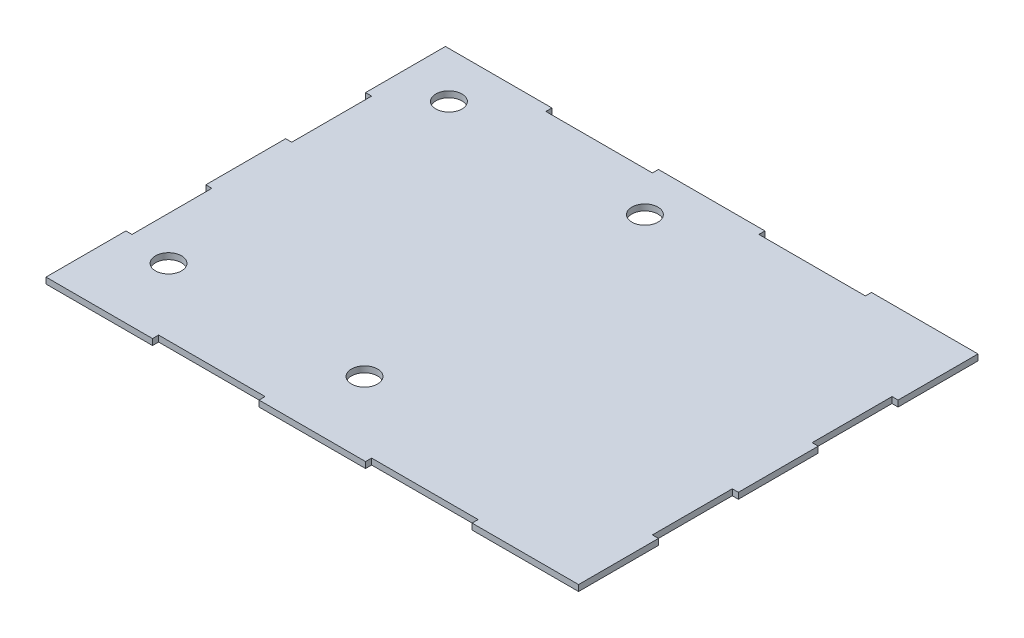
ISO-10303-21;
HEADER;
FILE_DESCRIPTION(('STEP AP214'),'2;1');
FILE_NAME('part.step','',(''),(''),'','','');
FILE_SCHEMA(('AUTOMOTIVE_DESIGN { 1 0 10303 214 1 1 1 1 }'));
ENDSEC;
DATA;
#1=APPLICATION_CONTEXT('core data for automotive mechanical design processes');
#2=APPLICATION_PROTOCOL_DEFINITION('international standard','automotive_design',2000,#1);
#3=PRODUCT_CONTEXT('',#1,'mechanical');
#4=PRODUCT('Part','Part','',(#3));
#5=PRODUCT_RELATED_PRODUCT_CATEGORY('part','',(#4));
#6=PRODUCT_DEFINITION_FORMATION('','',#4);
#7=PRODUCT_DEFINITION_CONTEXT('part definition',#1,'design');
#8=PRODUCT_DEFINITION('design','',#6,#7);
#9=PRODUCT_DEFINITION_SHAPE('','',#8);
#10=(LENGTH_UNIT() NAMED_UNIT(*) SI_UNIT(.MILLI.,.METRE.));
#11=(NAMED_UNIT(*) PLANE_ANGLE_UNIT() SI_UNIT($,.RADIAN.));
#12=(NAMED_UNIT(*) SI_UNIT($,.STERADIAN.) SOLID_ANGLE_UNIT());
#13=UNCERTAINTY_MEASURE_WITH_UNIT(LENGTH_MEASURE(1.E-05),#10,'distance_accuracy_value','');
#14=(GEOMETRIC_REPRESENTATION_CONTEXT(3) GLOBAL_UNCERTAINTY_ASSIGNED_CONTEXT((#13)) GLOBAL_UNIT_ASSIGNED_CONTEXT((#10,
#11,#12)) REPRESENTATION_CONTEXT('',''));
#15=CARTESIAN_POINT('',(0.,0.,0.));
#16=DIRECTION('',(0.,0.,1.));
#17=DIRECTION('',(1.,0.,0.));
#18=AXIS2_PLACEMENT_3D('',#15,#16,#17);
#19=CARTESIAN_POINT('',(60.0000000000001,2.28,75.));
#20=DIRECTION('',(0.,0.,-1.));
#21=DIRECTION('',(-1.,0.,0.));
#22=AXIS2_PLACEMENT_3D('',#19,#20,#21);
#23=PLANE('',#22);
#24=DIRECTION('',(1.,0.,0.));
#25=VECTOR('',#24,1.);
#26=CARTESIAN_POINT('',(60.0000000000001,0.,75.));
#27=LINE('',#26,#25);
#28=CARTESIAN_POINT('',(60.0000000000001,0.,75.));
#29=VERTEX_POINT('',#28);
#30=CARTESIAN_POINT('',(100.,0.,75.));
#31=VERTEX_POINT('',#30);
#32=EDGE_CURVE('E303',#29,#31,#27,.T.);
#33=ORIENTED_EDGE('',*,*,#32,.T.);
#34=DIRECTION('',(0.,-1.,0.));
#35=VECTOR('',#34,1.);
#36=CARTESIAN_POINT('',(100.,2.28,75.));
#37=LINE('',#36,#35);
#38=CARTESIAN_POINT('',(100.,2.28,75.));
#39=VERTEX_POINT('',#38);
#40=EDGE_CURVE('E11',#39,#31,#37,.T.);
#41=ORIENTED_EDGE('',*,*,#40,.F.);
#42=DIRECTION('',(1.,0.,0.));
#43=VECTOR('',#42,1.);
#44=CARTESIAN_POINT('',(60.0000000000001,2.28,75.));
#45=LINE('',#44,#43);
#46=CARTESIAN_POINT('',(60.0000000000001,2.28,75.));
#47=VERTEX_POINT('',#46);
#48=EDGE_CURVE('E373',#47,#39,#45,.T.);
#49=ORIENTED_EDGE('',*,*,#48,.F.);
#50=DIRECTION('',(0.,-1.,0.));
#51=VECTOR('',#50,1.);
#52=CARTESIAN_POINT('',(60.0000000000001,2.28,75.));
#53=LINE('',#52,#51);
#54=EDGE_CURVE('E299',#47,#29,#53,.T.);
#55=ORIENTED_EDGE('',*,*,#54,.T.);
#56=EDGE_LOOP('',(#33,#41,#49,#55));
#57=FACE_BOUND('',#56,.T.);
#58=ADVANCED_FACE('F37',(#57),#23,.F.);
#59=CARTESIAN_POINT('',(100.,2.28,45.));
#60=DIRECTION('',(-1.,0.,0.));
#61=DIRECTION('',(0.,0.,1.));
#62=AXIS2_PLACEMENT_3D('',#59,#60,#61);
#63=PLANE('',#62);
#64=DIRECTION('',(0.,0.,-1.));
#65=VECTOR('',#64,1.);
#66=CARTESIAN_POINT('',(100.,0.,45.));
#67=LINE('',#66,#65);
#68=CARTESIAN_POINT('',(100.,0.,45.));
#69=VERTEX_POINT('',#68);
#70=EDGE_CURVE('E306',#31,#69,#67,.T.);
#71=ORIENTED_EDGE('',*,*,#70,.T.);
#72=DIRECTION('',(0.,-1.,0.));
#73=VECTOR('',#72,1.);
#74=CARTESIAN_POINT('',(100.,2.28,45.));
#75=LINE('',#74,#73);
#76=CARTESIAN_POINT('',(100.,2.28,45.));
#77=VERTEX_POINT('',#76);
#78=EDGE_CURVE('E46',#77,#69,#75,.T.);
#79=ORIENTED_EDGE('',*,*,#78,.F.);
#80=DIRECTION('',(0.,0.,-1.));
#81=VECTOR('',#80,1.);
#82=CARTESIAN_POINT('',(100.,2.28,45.));
#83=LINE('',#82,#81);
#84=EDGE_CURVE('E182',#39,#77,#83,.T.);
#85=ORIENTED_EDGE('',*,*,#84,.F.);
#86=ORIENTED_EDGE('',*,*,#40,.T.);
#87=EDGE_LOOP('',(#71,#79,#85,#86));
#88=FACE_BOUND('',#87,.T.);
#89=ADVANCED_FACE('F511',(#88),#63,.F.);
#90=CARTESIAN_POINT('',(97.72,2.28,45.));
#91=DIRECTION('',(0.,0.,1.));
#92=DIRECTION('',(1.,0.,0.));
#93=AXIS2_PLACEMENT_3D('',#90,#91,#92);
#94=PLANE('',#93);
#95=DIRECTION('',(-1.,0.,0.));
#96=VECTOR('',#95,1.);
#97=CARTESIAN_POINT('',(97.72,0.,45.));
#98=LINE('',#97,#96);
#99=CARTESIAN_POINT('',(97.72,0.,45.));
#100=VERTEX_POINT('',#99);
#101=EDGE_CURVE('E308',#69,#100,#98,.T.);
#102=ORIENTED_EDGE('',*,*,#101,.T.);
#103=DIRECTION('',(0.,-1.,0.));
#104=VECTOR('',#103,1.);
#105=CARTESIAN_POINT('',(97.72,2.28,45.));
#106=LINE('',#105,#104);
#107=CARTESIAN_POINT('',(97.72,2.28,45.));
#108=VERTEX_POINT('',#107);
#109=EDGE_CURVE('E464',#108,#100,#106,.T.);
#110=ORIENTED_EDGE('',*,*,#109,.F.);
#111=DIRECTION('',(-1.,0.,0.));
#112=VECTOR('',#111,1.);
#113=CARTESIAN_POINT('',(97.72,2.28,45.));
#114=LINE('',#113,#112);
#115=EDGE_CURVE('E1002',#77,#108,#114,.T.);
#116=ORIENTED_EDGE('',*,*,#115,.F.);
#117=ORIENTED_EDGE('',*,*,#78,.T.);
#118=EDGE_LOOP('',(#102,#110,#116,#117));
#119=FACE_BOUND('',#118,.T.);
#120=ADVANCED_FACE('F515',(#119),#94,.F.);
#121=CARTESIAN_POINT('',(97.72,2.28,15.));
#122=DIRECTION('',(-1.,0.,0.));
#123=DIRECTION('',(0.,0.,1.));
#124=AXIS2_PLACEMENT_3D('',#121,#122,#123);
#125=PLANE('',#124);
#126=DIRECTION('',(0.,0.,-1.));
#127=VECTOR('',#126,1.);
#128=CARTESIAN_POINT('',(97.72,0.,15.));
#129=LINE('',#128,#127);
#130=CARTESIAN_POINT('',(97.72,0.,15.));
#131=VERTEX_POINT('',#130);
#132=EDGE_CURVE('E310',#100,#131,#129,.T.);
#133=ORIENTED_EDGE('',*,*,#132,.T.);
#134=DIRECTION('',(0.,-1.,0.));
#135=VECTOR('',#134,1.);
#136=CARTESIAN_POINT('',(97.72,2.28,15.));
#137=LINE('',#136,#135);
#138=CARTESIAN_POINT('',(97.72,2.28,15.));
#139=VERTEX_POINT('',#138);
#140=EDGE_CURVE('E461',#139,#131,#137,.T.);
#141=ORIENTED_EDGE('',*,*,#140,.F.);
#142=DIRECTION('',(0.,0.,-1.));
#143=VECTOR('',#142,1.);
#144=CARTESIAN_POINT('',(97.72,2.28,15.));
#145=LINE('',#144,#143);
#146=EDGE_CURVE('E1004',#108,#139,#145,.T.);
#147=ORIENTED_EDGE('',*,*,#146,.F.);
#148=ORIENTED_EDGE('',*,*,#109,.T.);
#149=EDGE_LOOP('',(#133,#141,#147,#148));
#150=FACE_BOUND('',#149,.T.);
#151=ADVANCED_FACE('F519',(#150),#125,.F.);
#152=CARTESIAN_POINT('',(100.,2.28,15.));
#153=DIRECTION('',(0.,0.,-1.));
#154=DIRECTION('',(-1.,0.,0.));
#155=AXIS2_PLACEMENT_3D('',#152,#153,#154);
#156=PLANE('',#155);
#157=DIRECTION('',(1.,0.,0.));
#158=VECTOR('',#157,1.);
#159=CARTESIAN_POINT('',(100.,0.,15.));
#160=LINE('',#159,#158);
#161=CARTESIAN_POINT('',(100.,0.,15.));
#162=VERTEX_POINT('',#161);
#163=EDGE_CURVE('E312',#131,#162,#160,.T.);
#164=ORIENTED_EDGE('',*,*,#163,.T.);
#165=DIRECTION('',(0.,-1.,0.));
#166=VECTOR('',#165,1.);
#167=CARTESIAN_POINT('',(100.,2.28,15.));
#168=LINE('',#167,#166);
#169=CARTESIAN_POINT('',(100.,2.28,15.));
#170=VERTEX_POINT('',#169);
#171=EDGE_CURVE('E458',#170,#162,#168,.T.);
#172=ORIENTED_EDGE('',*,*,#171,.F.);
#173=DIRECTION('',(1.,0.,0.));
#174=VECTOR('',#173,1.);
#175=CARTESIAN_POINT('',(100.,2.28,15.));
#176=LINE('',#175,#174);
#177=EDGE_CURVE('E1006',#139,#170,#176,.T.);
#178=ORIENTED_EDGE('',*,*,#177,.F.);
#179=ORIENTED_EDGE('',*,*,#140,.T.);
#180=EDGE_LOOP('',(#164,#172,#178,#179));
#181=FACE_BOUND('',#180,.T.);
#182=ADVANCED_FACE('F525',(#181),#156,.F.);
#183=CARTESIAN_POINT('',(100.,2.28,-15.));
#184=DIRECTION('',(-1.,0.,0.));
#185=DIRECTION('',(0.,0.,1.));
#186=AXIS2_PLACEMENT_3D('',#183,#184,#185);
#187=PLANE('',#186);
#188=DIRECTION('',(0.,0.,-1.));
#189=VECTOR('',#188,1.);
#190=CARTESIAN_POINT('',(100.,0.,-15.));
#191=LINE('',#190,#189);
#192=CARTESIAN_POINT('',(100.,0.,-15.));
#193=VERTEX_POINT('',#192);
#194=EDGE_CURVE('E314',#162,#193,#191,.T.);
#195=ORIENTED_EDGE('',*,*,#194,.T.);
#196=DIRECTION('',(0.,-1.,0.));
#197=VECTOR('',#196,1.);
#198=CARTESIAN_POINT('',(100.,2.28,-15.));
#199=LINE('',#198,#197);
#200=CARTESIAN_POINT('',(100.,2.28,-15.));
#201=VERTEX_POINT('',#200);
#202=EDGE_CURVE('E455',#201,#193,#199,.T.);
#203=ORIENTED_EDGE('',*,*,#202,.F.);
#204=DIRECTION('',(0.,0.,-1.));
#205=VECTOR('',#204,1.);
#206=CARTESIAN_POINT('',(100.,2.28,-15.));
#207=LINE('',#206,#205);
#208=EDGE_CURVE('E1008',#170,#201,#207,.T.);
#209=ORIENTED_EDGE('',*,*,#208,.F.);
#210=ORIENTED_EDGE('',*,*,#171,.T.);
#211=EDGE_LOOP('',(#195,#203,#209,#210));
#212=FACE_BOUND('',#211,.T.);
#213=ADVANCED_FACE('F529',(#212),#187,.F.);
#214=CARTESIAN_POINT('',(97.72,2.28,-15.));
#215=DIRECTION('',(0.,0.,1.));
#216=DIRECTION('',(1.,0.,0.));
#217=AXIS2_PLACEMENT_3D('',#214,#215,#216);
#218=PLANE('',#217);
#219=DIRECTION('',(-1.,0.,0.));
#220=VECTOR('',#219,1.);
#221=CARTESIAN_POINT('',(97.72,0.,-15.));
#222=LINE('',#221,#220);
#223=CARTESIAN_POINT('',(97.72,0.,-15.));
#224=VERTEX_POINT('',#223);
#225=EDGE_CURVE('E316',#193,#224,#222,.T.);
#226=ORIENTED_EDGE('',*,*,#225,.T.);
#227=DIRECTION('',(0.,-1.,0.));
#228=VECTOR('',#227,1.);
#229=CARTESIAN_POINT('',(97.72,2.28,-15.));
#230=LINE('',#229,#228);
#231=CARTESIAN_POINT('',(97.72,2.28,-15.));
#232=VERTEX_POINT('',#231);
#233=EDGE_CURVE('E452',#232,#224,#230,.T.);
#234=ORIENTED_EDGE('',*,*,#233,.F.);
#235=DIRECTION('',(-1.,0.,0.));
#236=VECTOR('',#235,1.);
#237=CARTESIAN_POINT('',(97.72,2.28,-15.));
#238=LINE('',#237,#236);
#239=EDGE_CURVE('E1010',#201,#232,#238,.T.);
#240=ORIENTED_EDGE('',*,*,#239,.F.);
#241=ORIENTED_EDGE('',*,*,#202,.T.);
#242=EDGE_LOOP('',(#226,#234,#240,#241));
#243=FACE_BOUND('',#242,.T.);
#244=ADVANCED_FACE('F533',(#243),#218,.F.);
#245=CARTESIAN_POINT('',(97.72,2.28,-45.));
#246=DIRECTION('',(-1.,0.,0.));
#247=DIRECTION('',(0.,0.,1.));
#248=AXIS2_PLACEMENT_3D('',#245,#246,#247);
#249=PLANE('',#248);
#250=DIRECTION('',(0.,0.,-1.));
#251=VECTOR('',#250,1.);
#252=CARTESIAN_POINT('',(97.72,0.,-45.));
#253=LINE('',#252,#251);
#254=CARTESIAN_POINT('',(97.72,0.,-45.));
#255=VERTEX_POINT('',#254);
#256=EDGE_CURVE('E318',#224,#255,#253,.T.);
#257=ORIENTED_EDGE('',*,*,#256,.T.);
#258=DIRECTION('',(0.,-1.,0.));
#259=VECTOR('',#258,1.);
#260=CARTESIAN_POINT('',(97.72,2.28,-45.));
#261=LINE('',#260,#259);
#262=CARTESIAN_POINT('',(97.72,2.28,-45.));
#263=VERTEX_POINT('',#262);
#264=EDGE_CURVE('E449',#263,#255,#261,.T.);
#265=ORIENTED_EDGE('',*,*,#264,.F.);
#266=DIRECTION('',(0.,0.,-1.));
#267=VECTOR('',#266,1.);
#268=CARTESIAN_POINT('',(97.72,2.28,-45.));
#269=LINE('',#268,#267);
#270=EDGE_CURVE('E1012',#232,#263,#269,.T.);
#271=ORIENTED_EDGE('',*,*,#270,.F.);
#272=ORIENTED_EDGE('',*,*,#233,.T.);
#273=EDGE_LOOP('',(#257,#265,#271,#272));
#274=FACE_BOUND('',#273,.T.);
#275=ADVANCED_FACE('F537',(#274),#249,.F.);
#276=CARTESIAN_POINT('',(100.,2.28,-45.));
#277=DIRECTION('',(0.,0.,-1.));
#278=DIRECTION('',(-1.,0.,0.));
#279=AXIS2_PLACEMENT_3D('',#276,#277,#278);
#280=PLANE('',#279);
#281=DIRECTION('',(1.,0.,0.));
#282=VECTOR('',#281,1.);
#283=CARTESIAN_POINT('',(100.,0.,-45.));
#284=LINE('',#283,#282);
#285=CARTESIAN_POINT('',(100.,0.,-45.));
#286=VERTEX_POINT('',#285);
#287=EDGE_CURVE('E320',#255,#286,#284,.T.);
#288=ORIENTED_EDGE('',*,*,#287,.T.);
#289=DIRECTION('',(0.,-1.,0.));
#290=VECTOR('',#289,1.);
#291=CARTESIAN_POINT('',(100.,2.28,-45.));
#292=LINE('',#291,#290);
#293=CARTESIAN_POINT('',(100.,2.28,-45.));
#294=VERTEX_POINT('',#293);
#295=EDGE_CURVE('E446',#294,#286,#292,.T.);
#296=ORIENTED_EDGE('',*,*,#295,.F.);
#297=DIRECTION('',(1.,0.,0.));
#298=VECTOR('',#297,1.);
#299=CARTESIAN_POINT('',(100.,2.28,-45.));
#300=LINE('',#299,#298);
#301=EDGE_CURVE('E1014',#263,#294,#300,.T.);
#302=ORIENTED_EDGE('',*,*,#301,.F.);
#303=ORIENTED_EDGE('',*,*,#264,.T.);
#304=EDGE_LOOP('',(#288,#296,#302,#303));
#305=FACE_BOUND('',#304,.T.);
#306=ADVANCED_FACE('F541',(#305),#280,.F.);
#307=CARTESIAN_POINT('',(100.,2.28,-45.));
#308=DIRECTION('',(-1.,0.,0.));
#309=DIRECTION('',(0.,0.,1.));
#310=AXIS2_PLACEMENT_3D('',#307,#308,#309);
#311=PLANE('',#310);
#312=DIRECTION('',(0.,0.,-1.));
#313=VECTOR('',#312,1.);
#314=CARTESIAN_POINT('',(100.,0.,-45.));
#315=LINE('',#314,#313);
#316=CARTESIAN_POINT('',(100.,0.,-75.));
#317=VERTEX_POINT('',#316);
#318=EDGE_CURVE('E322',#286,#317,#315,.T.);
#319=ORIENTED_EDGE('',*,*,#318,.T.);
#320=DIRECTION('',(0.,-1.,0.));
#321=VECTOR('',#320,1.);
#322=CARTESIAN_POINT('',(100.,2.28,-75.));
#323=LINE('',#322,#321);
#324=CARTESIAN_POINT('',(100.,2.28,-75.));
#325=VERTEX_POINT('',#324);
#326=EDGE_CURVE('E443',#325,#317,#323,.T.);
#327=ORIENTED_EDGE('',*,*,#326,.F.);
#328=DIRECTION('',(0.,0.,-1.));
#329=VECTOR('',#328,1.);
#330=CARTESIAN_POINT('',(100.,2.28,-45.));
#331=LINE('',#330,#329);
#332=EDGE_CURVE('E1016',#294,#325,#331,.T.);
#333=ORIENTED_EDGE('',*,*,#332,.F.);
#334=ORIENTED_EDGE('',*,*,#295,.T.);
#335=EDGE_LOOP('',(#319,#327,#333,#334));
#336=FACE_BOUND('',#335,.T.);
#337=ADVANCED_FACE('F545',(#336),#311,.F.);
#338=CARTESIAN_POINT('',(60.,2.28,-75.));
#339=DIRECTION('',(0.,0.,1.));
#340=DIRECTION('',(1.,0.,0.));
#341=AXIS2_PLACEMENT_3D('',#338,#339,#340);
#342=PLANE('',#341);
#343=DIRECTION('',(-1.,0.,0.));
#344=VECTOR('',#343,1.);
#345=CARTESIAN_POINT('',(60.,0.,-75.));
#346=LINE('',#345,#344);
#347=CARTESIAN_POINT('',(60.,0.,-75.));
#348=VERTEX_POINT('',#347);
#349=EDGE_CURVE('E324',#317,#348,#346,.T.);
#350=ORIENTED_EDGE('',*,*,#349,.T.);
#351=DIRECTION('',(0.,-1.,0.));
#352=VECTOR('',#351,1.);
#353=CARTESIAN_POINT('',(60.,2.28,-75.));
#354=LINE('',#353,#352);
#355=CARTESIAN_POINT('',(60.,2.28,-75.));
#356=VERTEX_POINT('',#355);
#357=EDGE_CURVE('E440',#356,#348,#354,.T.);
#358=ORIENTED_EDGE('',*,*,#357,.F.);
#359=DIRECTION('',(-1.,0.,0.));
#360=VECTOR('',#359,1.);
#361=CARTESIAN_POINT('',(60.,2.28,-75.));
#362=LINE('',#361,#360);
#363=EDGE_CURVE('E1018',#325,#356,#362,.T.);
#364=ORIENTED_EDGE('',*,*,#363,.F.);
#365=ORIENTED_EDGE('',*,*,#326,.T.);
#366=EDGE_LOOP('',(#350,#358,#364,#365));
#367=FACE_BOUND('',#366,.T.);
#368=ADVANCED_FACE('F549',(#367),#342,.F.);
#369=CARTESIAN_POINT('',(60.,2.28,-72.72));
#370=DIRECTION('',(1.,0.,0.));
#371=DIRECTION('',(0.,0.,-1.));
#372=AXIS2_PLACEMENT_3D('',#369,#370,#371);
#373=PLANE('',#372);
#374=DIRECTION('',(0.,0.,1.));
#375=VECTOR('',#374,1.);
#376=CARTESIAN_POINT('',(60.,0.,-72.72));
#377=LINE('',#376,#375);
#378=CARTESIAN_POINT('',(60.,0.,-72.72));
#379=VERTEX_POINT('',#378);
#380=EDGE_CURVE('E326',#348,#379,#377,.T.);
#381=ORIENTED_EDGE('',*,*,#380,.T.);
#382=DIRECTION('',(0.,-1.,0.));
#383=VECTOR('',#382,1.);
#384=CARTESIAN_POINT('',(60.,2.28,-72.72));
#385=LINE('',#384,#383);
#386=CARTESIAN_POINT('',(60.,2.28,-72.72));
#387=VERTEX_POINT('',#386);
#388=EDGE_CURVE('E437',#387,#379,#385,.T.);
#389=ORIENTED_EDGE('',*,*,#388,.F.);
#390=DIRECTION('',(0.,0.,1.));
#391=VECTOR('',#390,1.);
#392=CARTESIAN_POINT('',(60.,2.28,-72.72));
#393=LINE('',#392,#391);
#394=EDGE_CURVE('E1020',#356,#387,#393,.T.);
#395=ORIENTED_EDGE('',*,*,#394,.F.);
#396=ORIENTED_EDGE('',*,*,#357,.T.);
#397=EDGE_LOOP('',(#381,#389,#395,#396));
#398=FACE_BOUND('',#397,.T.);
#399=ADVANCED_FACE('F553',(#398),#373,.F.);
#400=CARTESIAN_POINT('',(20.,2.28,-72.72));
#401=DIRECTION('',(0.,0.,1.));
#402=DIRECTION('',(1.,0.,0.));
#403=AXIS2_PLACEMENT_3D('',#400,#401,#402);
#404=PLANE('',#403);
#405=DIRECTION('',(-1.,0.,0.));
#406=VECTOR('',#405,1.);
#407=CARTESIAN_POINT('',(20.,0.,-72.72));
#408=LINE('',#407,#406);
#409=CARTESIAN_POINT('',(20.,0.,-72.72));
#410=VERTEX_POINT('',#409);
#411=EDGE_CURVE('E328',#379,#410,#408,.T.);
#412=ORIENTED_EDGE('',*,*,#411,.T.);
#413=DIRECTION('',(0.,-1.,0.));
#414=VECTOR('',#413,1.);
#415=CARTESIAN_POINT('',(20.,2.28,-72.72));
#416=LINE('',#415,#414);
#417=CARTESIAN_POINT('',(20.,2.28,-72.72));
#418=VERTEX_POINT('',#417);
#419=EDGE_CURVE('E434',#418,#410,#416,.T.);
#420=ORIENTED_EDGE('',*,*,#419,.F.);
#421=DIRECTION('',(-1.,0.,0.));
#422=VECTOR('',#421,1.);
#423=CARTESIAN_POINT('',(20.,2.28,-72.72));
#424=LINE('',#423,#422);
#425=EDGE_CURVE('E1022',#387,#418,#424,.T.);
#426=ORIENTED_EDGE('',*,*,#425,.F.);
#427=ORIENTED_EDGE('',*,*,#388,.T.);
#428=EDGE_LOOP('',(#412,#420,#426,#427));
#429=FACE_BOUND('',#428,.T.);
#430=ADVANCED_FACE('F557',(#429),#404,.F.);
#431=CARTESIAN_POINT('',(20.,2.28,-75.));
#432=DIRECTION('',(-1.,0.,0.));
#433=DIRECTION('',(0.,0.,1.));
#434=AXIS2_PLACEMENT_3D('',#431,#432,#433);
#435=PLANE('',#434);
#436=DIRECTION('',(0.,0.,-1.));
#437=VECTOR('',#436,1.);
#438=CARTESIAN_POINT('',(20.,0.,-75.));
#439=LINE('',#438,#437);
#440=CARTESIAN_POINT('',(20.,0.,-75.));
#441=VERTEX_POINT('',#440);
#442=EDGE_CURVE('E330',#410,#441,#439,.T.);
#443=ORIENTED_EDGE('',*,*,#442,.T.);
#444=DIRECTION('',(0.,-1.,0.));
#445=VECTOR('',#444,1.);
#446=CARTESIAN_POINT('',(20.,2.28,-75.));
#447=LINE('',#446,#445);
#448=CARTESIAN_POINT('',(20.,2.28,-75.));
#449=VERTEX_POINT('',#448);
#450=EDGE_CURVE('E431',#449,#441,#447,.T.);
#451=ORIENTED_EDGE('',*,*,#450,.F.);
#452=DIRECTION('',(0.,0.,-1.));
#453=VECTOR('',#452,1.);
#454=CARTESIAN_POINT('',(20.,2.28,-75.));
#455=LINE('',#454,#453);
#456=EDGE_CURVE('E1024',#418,#449,#455,.T.);
#457=ORIENTED_EDGE('',*,*,#456,.F.);
#458=ORIENTED_EDGE('',*,*,#419,.T.);
#459=EDGE_LOOP('',(#443,#451,#457,#458));
#460=FACE_BOUND('',#459,.T.);
#461=ADVANCED_FACE('F561',(#460),#435,.F.);
#462=CARTESIAN_POINT('',(-20.,2.28,-75.));
#463=DIRECTION('',(0.,0.,1.));
#464=DIRECTION('',(1.,0.,0.));
#465=AXIS2_PLACEMENT_3D('',#462,#463,#464);
#466=PLANE('',#465);
#467=DIRECTION('',(-1.,0.,0.));
#468=VECTOR('',#467,1.);
#469=CARTESIAN_POINT('',(-20.,0.,-75.));
#470=LINE('',#469,#468);
#471=CARTESIAN_POINT('',(-20.,0.,-75.));
#472=VERTEX_POINT('',#471);
#473=EDGE_CURVE('E332',#441,#472,#470,.T.);
#474=ORIENTED_EDGE('',*,*,#473,.T.);
#475=DIRECTION('',(0.,-1.,0.));
#476=VECTOR('',#475,1.);
#477=CARTESIAN_POINT('',(-20.,2.28,-75.));
#478=LINE('',#477,#476);
#479=CARTESIAN_POINT('',(-20.,2.28,-75.));
#480=VERTEX_POINT('',#479);
#481=EDGE_CURVE('E428',#480,#472,#478,.T.);
#482=ORIENTED_EDGE('',*,*,#481,.F.);
#483=DIRECTION('',(-1.,0.,0.));
#484=VECTOR('',#483,1.);
#485=CARTESIAN_POINT('',(-20.,2.28,-75.));
#486=LINE('',#485,#484);
#487=EDGE_CURVE('E1026',#449,#480,#486,.T.);
#488=ORIENTED_EDGE('',*,*,#487,.F.);
#489=ORIENTED_EDGE('',*,*,#450,.T.);
#490=EDGE_LOOP('',(#474,#482,#488,#489));
#491=FACE_BOUND('',#490,.T.);
#492=ADVANCED_FACE('F565',(#491),#466,.F.);
#493=CARTESIAN_POINT('',(-20.,2.28,-72.72));
#494=DIRECTION('',(1.,0.,0.));
#495=DIRECTION('',(0.,0.,-1.));
#496=AXIS2_PLACEMENT_3D('',#493,#494,#495);
#497=PLANE('',#496);
#498=DIRECTION('',(0.,0.,1.));
#499=VECTOR('',#498,1.);
#500=CARTESIAN_POINT('',(-20.,0.,-72.72));
#501=LINE('',#500,#499);
#502=CARTESIAN_POINT('',(-20.,0.,-72.72));
#503=VERTEX_POINT('',#502);
#504=EDGE_CURVE('E334',#472,#503,#501,.T.);
#505=ORIENTED_EDGE('',*,*,#504,.T.);
#506=DIRECTION('',(0.,-1.,0.));
#507=VECTOR('',#506,1.);
#508=CARTESIAN_POINT('',(-20.,2.28,-72.72));
#509=LINE('',#508,#507);
#510=CARTESIAN_POINT('',(-20.,2.28,-72.72));
#511=VERTEX_POINT('',#510);
#512=EDGE_CURVE('E425',#511,#503,#509,.T.);
#513=ORIENTED_EDGE('',*,*,#512,.F.);
#514=DIRECTION('',(0.,0.,1.));
#515=VECTOR('',#514,1.);
#516=CARTESIAN_POINT('',(-20.,2.28,-72.72));
#517=LINE('',#516,#515);
#518=EDGE_CURVE('E1028',#480,#511,#517,.T.);
#519=ORIENTED_EDGE('',*,*,#518,.F.);
#520=ORIENTED_EDGE('',*,*,#481,.T.);
#521=EDGE_LOOP('',(#505,#513,#519,#520));
#522=FACE_BOUND('',#521,.T.);
#523=ADVANCED_FACE('F569',(#522),#497,.F.);
#524=CARTESIAN_POINT('',(-60.,2.28,-72.72));
#525=DIRECTION('',(0.,0.,1.));
#526=DIRECTION('',(1.,0.,0.));
#527=AXIS2_PLACEMENT_3D('',#524,#525,#526);
#528=PLANE('',#527);
#529=DIRECTION('',(-1.,0.,0.));
#530=VECTOR('',#529,1.);
#531=CARTESIAN_POINT('',(-60.,0.,-72.72));
#532=LINE('',#531,#530);
#533=CARTESIAN_POINT('',(-60.,0.,-72.72));
#534=VERTEX_POINT('',#533);
#535=EDGE_CURVE('E336',#503,#534,#532,.T.);
#536=ORIENTED_EDGE('',*,*,#535,.T.);
#537=DIRECTION('',(0.,-1.,0.));
#538=VECTOR('',#537,1.);
#539=CARTESIAN_POINT('',(-60.,2.28,-72.72));
#540=LINE('',#539,#538);
#541=CARTESIAN_POINT('',(-60.,2.28,-72.72));
#542=VERTEX_POINT('',#541);
#543=EDGE_CURVE('E422',#542,#534,#540,.T.);
#544=ORIENTED_EDGE('',*,*,#543,.F.);
#545=DIRECTION('',(-1.,0.,0.));
#546=VECTOR('',#545,1.);
#547=CARTESIAN_POINT('',(-60.,2.28,-72.72));
#548=LINE('',#547,#546);
#549=EDGE_CURVE('E1030',#511,#542,#548,.T.);
#550=ORIENTED_EDGE('',*,*,#549,.F.);
#551=ORIENTED_EDGE('',*,*,#512,.T.);
#552=EDGE_LOOP('',(#536,#544,#550,#551));
#553=FACE_BOUND('',#552,.T.);
#554=ADVANCED_FACE('F573',(#553),#528,.F.);
#555=CARTESIAN_POINT('',(-60.,2.28,-75.));
#556=DIRECTION('',(-1.,0.,0.));
#557=DIRECTION('',(0.,0.,1.));
#558=AXIS2_PLACEMENT_3D('',#555,#556,#557);
#559=PLANE('',#558);
#560=DIRECTION('',(0.,0.,-1.));
#561=VECTOR('',#560,1.);
#562=CARTESIAN_POINT('',(-60.,0.,-75.));
#563=LINE('',#562,#561);
#564=CARTESIAN_POINT('',(-60.,0.,-75.));
#565=VERTEX_POINT('',#564);
#566=EDGE_CURVE('E338',#534,#565,#563,.T.);
#567=ORIENTED_EDGE('',*,*,#566,.T.);
#568=DIRECTION('',(0.,-1.,0.));
#569=VECTOR('',#568,1.);
#570=CARTESIAN_POINT('',(-60.,2.28,-75.));
#571=LINE('',#570,#569);
#572=CARTESIAN_POINT('',(-60.,2.28,-75.));
#573=VERTEX_POINT('',#572);
#574=EDGE_CURVE('E419',#573,#565,#571,.T.);
#575=ORIENTED_EDGE('',*,*,#574,.F.);
#576=DIRECTION('',(0.,0.,-1.));
#577=VECTOR('',#576,1.);
#578=CARTESIAN_POINT('',(-60.,2.28,-75.));
#579=LINE('',#578,#577);
#580=EDGE_CURVE('E1032',#542,#573,#579,.T.);
#581=ORIENTED_EDGE('',*,*,#580,.F.);
#582=ORIENTED_EDGE('',*,*,#543,.T.);
#583=EDGE_LOOP('',(#567,#575,#581,#582));
#584=FACE_BOUND('',#583,.T.);
#585=ADVANCED_FACE('F577',(#584),#559,.F.);
#586=CARTESIAN_POINT('',(-100.,2.28,-75.));
#587=DIRECTION('',(0.,0.,1.));
#588=DIRECTION('',(1.,0.,0.));
#589=AXIS2_PLACEMENT_3D('',#586,#587,#588);
#590=PLANE('',#589);
#591=DIRECTION('',(-1.,0.,0.));
#592=VECTOR('',#591,1.);
#593=CARTESIAN_POINT('',(-100.,0.,-75.));
#594=LINE('',#593,#592);
#595=CARTESIAN_POINT('',(-100.,0.,-75.));
#596=VERTEX_POINT('',#595);
#597=EDGE_CURVE('E340',#565,#596,#594,.T.);
#598=ORIENTED_EDGE('',*,*,#597,.T.);
#599=DIRECTION('',(0.,-1.,0.));
#600=VECTOR('',#599,1.);
#601=CARTESIAN_POINT('',(-100.,2.28,-75.));
#602=LINE('',#601,#600);
#603=CARTESIAN_POINT('',(-100.,2.28,-75.));
#604=VERTEX_POINT('',#603);
#605=EDGE_CURVE('E416',#604,#596,#602,.T.);
#606=ORIENTED_EDGE('',*,*,#605,.F.);
#607=DIRECTION('',(-1.,0.,0.));
#608=VECTOR('',#607,1.);
#609=CARTESIAN_POINT('',(-100.,2.28,-75.));
#610=LINE('',#609,#608);
#611=EDGE_CURVE('E1034',#573,#604,#610,.T.);
#612=ORIENTED_EDGE('',*,*,#611,.F.);
#613=ORIENTED_EDGE('',*,*,#574,.T.);
#614=EDGE_LOOP('',(#598,#606,#612,#613));
#615=FACE_BOUND('',#614,.T.);
#616=ADVANCED_FACE('F581',(#615),#590,.F.);
#617=CARTESIAN_POINT('',(-100.,2.28,-45.));
#618=DIRECTION('',(1.,0.,0.));
#619=DIRECTION('',(0.,0.,-1.));
#620=AXIS2_PLACEMENT_3D('',#617,#618,#619);
#621=PLANE('',#620);
#622=DIRECTION('',(0.,0.,1.));
#623=VECTOR('',#622,1.);
#624=CARTESIAN_POINT('',(-100.,0.,-45.));
#625=LINE('',#624,#623);
#626=CARTESIAN_POINT('',(-100.,0.,-45.));
#627=VERTEX_POINT('',#626);
#628=EDGE_CURVE('E342',#596,#627,#625,.T.);
#629=ORIENTED_EDGE('',*,*,#628,.T.);
#630=DIRECTION('',(0.,-1.,0.));
#631=VECTOR('',#630,1.);
#632=CARTESIAN_POINT('',(-100.,2.28,-45.));
#633=LINE('',#632,#631);
#634=CARTESIAN_POINT('',(-100.,2.28,-45.));
#635=VERTEX_POINT('',#634);
#636=EDGE_CURVE('E413',#635,#627,#633,.T.);
#637=ORIENTED_EDGE('',*,*,#636,.F.);
#638=DIRECTION('',(0.,0.,1.));
#639=VECTOR('',#638,1.);
#640=CARTESIAN_POINT('',(-100.,2.28,-45.));
#641=LINE('',#640,#639);
#642=EDGE_CURVE('E1036',#604,#635,#641,.T.);
#643=ORIENTED_EDGE('',*,*,#642,.F.);
#644=ORIENTED_EDGE('',*,*,#605,.T.);
#645=EDGE_LOOP('',(#629,#637,#643,#644));
#646=FACE_BOUND('',#645,.T.);
#647=ADVANCED_FACE('F585',(#646),#621,.F.);
#648=CARTESIAN_POINT('',(-97.72,2.28,-45.));
#649=DIRECTION('',(0.,0.,-1.));
#650=DIRECTION('',(-1.,0.,0.));
#651=AXIS2_PLACEMENT_3D('',#648,#649,#650);
#652=PLANE('',#651);
#653=DIRECTION('',(1.,0.,0.));
#654=VECTOR('',#653,1.);
#655=CARTESIAN_POINT('',(-97.72,0.,-45.));
#656=LINE('',#655,#654);
#657=CARTESIAN_POINT('',(-97.72,0.,-45.));
#658=VERTEX_POINT('',#657);
#659=EDGE_CURVE('E344',#627,#658,#656,.T.);
#660=ORIENTED_EDGE('',*,*,#659,.T.);
#661=DIRECTION('',(0.,-1.,0.));
#662=VECTOR('',#661,1.);
#663=CARTESIAN_POINT('',(-97.72,2.28,-45.));
#664=LINE('',#663,#662);
#665=CARTESIAN_POINT('',(-97.72,2.28,-45.));
#666=VERTEX_POINT('',#665);
#667=EDGE_CURVE('E410',#666,#658,#664,.T.);
#668=ORIENTED_EDGE('',*,*,#667,.F.);
#669=DIRECTION('',(1.,0.,0.));
#670=VECTOR('',#669,1.);
#671=CARTESIAN_POINT('',(-97.72,2.28,-45.));
#672=LINE('',#671,#670);
#673=EDGE_CURVE('E1038',#635,#666,#672,.T.);
#674=ORIENTED_EDGE('',*,*,#673,.F.);
#675=ORIENTED_EDGE('',*,*,#636,.T.);
#676=EDGE_LOOP('',(#660,#668,#674,#675));
#677=FACE_BOUND('',#676,.T.);
#678=ADVANCED_FACE('F589',(#677),#652,.F.);
#679=CARTESIAN_POINT('',(-97.72,2.28,-15.));
#680=DIRECTION('',(1.,0.,0.));
#681=DIRECTION('',(0.,0.,-1.));
#682=AXIS2_PLACEMENT_3D('',#679,#680,#681);
#683=PLANE('',#682);
#684=DIRECTION('',(0.,0.,1.));
#685=VECTOR('',#684,1.);
#686=CARTESIAN_POINT('',(-97.72,0.,-15.));
#687=LINE('',#686,#685);
#688=CARTESIAN_POINT('',(-97.72,0.,-15.));
#689=VERTEX_POINT('',#688);
#690=EDGE_CURVE('E346',#658,#689,#687,.T.);
#691=ORIENTED_EDGE('',*,*,#690,.T.);
#692=DIRECTION('',(0.,-1.,0.));
#693=VECTOR('',#692,1.);
#694=CARTESIAN_POINT('',(-97.72,2.28,-15.));
#695=LINE('',#694,#693);
#696=CARTESIAN_POINT('',(-97.72,2.28,-15.));
#697=VERTEX_POINT('',#696);
#698=EDGE_CURVE('E407',#697,#689,#695,.T.);
#699=ORIENTED_EDGE('',*,*,#698,.F.);
#700=DIRECTION('',(0.,0.,1.));
#701=VECTOR('',#700,1.);
#702=CARTESIAN_POINT('',(-97.72,2.28,-15.));
#703=LINE('',#702,#701);
#704=EDGE_CURVE('E1040',#666,#697,#703,.T.);
#705=ORIENTED_EDGE('',*,*,#704,.F.);
#706=ORIENTED_EDGE('',*,*,#667,.T.);
#707=EDGE_LOOP('',(#691,#699,#705,#706));
#708=FACE_BOUND('',#707,.T.);
#709=ADVANCED_FACE('F593',(#708),#683,.F.);
#710=CARTESIAN_POINT('',(-100.,2.28,-15.));
#711=DIRECTION('',(0.,0.,1.));
#712=DIRECTION('',(1.,0.,0.));
#713=AXIS2_PLACEMENT_3D('',#710,#711,#712);
#714=PLANE('',#713);
#715=DIRECTION('',(-1.,0.,0.));
#716=VECTOR('',#715,1.);
#717=CARTESIAN_POINT('',(-100.,0.,-15.));
#718=LINE('',#717,#716);
#719=CARTESIAN_POINT('',(-100.,0.,-15.));
#720=VERTEX_POINT('',#719);
#721=EDGE_CURVE('E348',#689,#720,#718,.T.);
#722=ORIENTED_EDGE('',*,*,#721,.T.);
#723=DIRECTION('',(0.,-1.,0.));
#724=VECTOR('',#723,1.);
#725=CARTESIAN_POINT('',(-100.,2.28,-15.));
#726=LINE('',#725,#724);
#727=CARTESIAN_POINT('',(-100.,2.28,-15.));
#728=VERTEX_POINT('',#727);
#729=EDGE_CURVE('E404',#728,#720,#726,.T.);
#730=ORIENTED_EDGE('',*,*,#729,.F.);
#731=DIRECTION('',(-1.,0.,0.));
#732=VECTOR('',#731,1.);
#733=CARTESIAN_POINT('',(-100.,2.28,-15.));
#734=LINE('',#733,#732);
#735=EDGE_CURVE('E1042',#697,#728,#734,.T.);
#736=ORIENTED_EDGE('',*,*,#735,.F.);
#737=ORIENTED_EDGE('',*,*,#698,.T.);
#738=EDGE_LOOP('',(#722,#730,#736,#737));
#739=FACE_BOUND('',#738,.T.);
#740=ADVANCED_FACE('F597',(#739),#714,.F.);
#741=CARTESIAN_POINT('',(-100.,2.28,15.));
#742=DIRECTION('',(1.,0.,0.));
#743=DIRECTION('',(0.,0.,-1.));
#744=AXIS2_PLACEMENT_3D('',#741,#742,#743);
#745=PLANE('',#744);
#746=DIRECTION('',(0.,0.,1.));
#747=VECTOR('',#746,1.);
#748=CARTESIAN_POINT('',(-100.,0.,15.));
#749=LINE('',#748,#747);
#750=CARTESIAN_POINT('',(-100.,0.,15.));
#751=VERTEX_POINT('',#750);
#752=EDGE_CURVE('E350',#720,#751,#749,.T.);
#753=ORIENTED_EDGE('',*,*,#752,.T.);
#754=DIRECTION('',(0.,-1.,0.));
#755=VECTOR('',#754,1.);
#756=CARTESIAN_POINT('',(-100.,2.28,15.));
#757=LINE('',#756,#755);
#758=CARTESIAN_POINT('',(-100.,2.28,15.));
#759=VERTEX_POINT('',#758);
#760=EDGE_CURVE('E401',#759,#751,#757,.T.);
#761=ORIENTED_EDGE('',*,*,#760,.F.);
#762=DIRECTION('',(0.,0.,1.));
#763=VECTOR('',#762,1.);
#764=CARTESIAN_POINT('',(-100.,2.28,15.));
#765=LINE('',#764,#763);
#766=EDGE_CURVE('E1044',#728,#759,#765,.T.);
#767=ORIENTED_EDGE('',*,*,#766,.F.);
#768=ORIENTED_EDGE('',*,*,#729,.T.);
#769=EDGE_LOOP('',(#753,#761,#767,#768));
#770=FACE_BOUND('',#769,.T.);
#771=ADVANCED_FACE('F601',(#770),#745,.F.);
#772=CARTESIAN_POINT('',(-97.72,2.28,15.));
#773=DIRECTION('',(0.,0.,-1.));
#774=DIRECTION('',(-1.,0.,0.));
#775=AXIS2_PLACEMENT_3D('',#772,#773,#774);
#776=PLANE('',#775);
#777=DIRECTION('',(1.,0.,0.));
#778=VECTOR('',#777,1.);
#779=CARTESIAN_POINT('',(-97.72,0.,15.));
#780=LINE('',#779,#778);
#781=CARTESIAN_POINT('',(-97.72,0.,15.));
#782=VERTEX_POINT('',#781);
#783=EDGE_CURVE('E352',#751,#782,#780,.T.);
#784=ORIENTED_EDGE('',*,*,#783,.T.);
#785=DIRECTION('',(0.,-1.,0.));
#786=VECTOR('',#785,1.);
#787=CARTESIAN_POINT('',(-97.72,2.28,15.));
#788=LINE('',#787,#786);
#789=CARTESIAN_POINT('',(-97.72,2.28,15.));
#790=VERTEX_POINT('',#789);
#791=EDGE_CURVE('E398',#790,#782,#788,.T.);
#792=ORIENTED_EDGE('',*,*,#791,.F.);
#793=DIRECTION('',(1.,0.,0.));
#794=VECTOR('',#793,1.);
#795=CARTESIAN_POINT('',(-97.72,2.28,15.));
#796=LINE('',#795,#794);
#797=EDGE_CURVE('E1046',#759,#790,#796,.T.);
#798=ORIENTED_EDGE('',*,*,#797,.F.);
#799=ORIENTED_EDGE('',*,*,#760,.T.);
#800=EDGE_LOOP('',(#784,#792,#798,#799));
#801=FACE_BOUND('',#800,.T.);
#802=ADVANCED_FACE('F605',(#801),#776,.F.);
#803=CARTESIAN_POINT('',(-97.72,2.28,45.));
#804=DIRECTION('',(1.,0.,0.));
#805=DIRECTION('',(0.,0.,-1.));
#806=AXIS2_PLACEMENT_3D('',#803,#804,#805);
#807=PLANE('',#806);
#808=DIRECTION('',(0.,0.,1.));
#809=VECTOR('',#808,1.);
#810=CARTESIAN_POINT('',(-97.72,0.,45.));
#811=LINE('',#810,#809);
#812=CARTESIAN_POINT('',(-97.72,0.,45.));
#813=VERTEX_POINT('',#812);
#814=EDGE_CURVE('E354',#782,#813,#811,.T.);
#815=ORIENTED_EDGE('',*,*,#814,.T.);
#816=DIRECTION('',(0.,-1.,0.));
#817=VECTOR('',#816,1.);
#818=CARTESIAN_POINT('',(-97.72,2.28,45.));
#819=LINE('',#818,#817);
#820=CARTESIAN_POINT('',(-97.72,2.28,45.));
#821=VERTEX_POINT('',#820);
#822=EDGE_CURVE('E395',#821,#813,#819,.T.);
#823=ORIENTED_EDGE('',*,*,#822,.F.);
#824=DIRECTION('',(0.,0.,1.));
#825=VECTOR('',#824,1.);
#826=CARTESIAN_POINT('',(-97.72,2.28,45.));
#827=LINE('',#826,#825);
#828=EDGE_CURVE('E1048',#790,#821,#827,.T.);
#829=ORIENTED_EDGE('',*,*,#828,.F.);
#830=ORIENTED_EDGE('',*,*,#791,.T.);
#831=EDGE_LOOP('',(#815,#823,#829,#830));
#832=FACE_BOUND('',#831,.T.);
#833=ADVANCED_FACE('F609',(#832),#807,.F.);
#834=CARTESIAN_POINT('',(-100.,2.28,45.));
#835=DIRECTION('',(0.,0.,1.));
#836=DIRECTION('',(1.,0.,0.));
#837=AXIS2_PLACEMENT_3D('',#834,#835,#836);
#838=PLANE('',#837);
#839=DIRECTION('',(-1.,0.,0.));
#840=VECTOR('',#839,1.);
#841=CARTESIAN_POINT('',(-100.,0.,45.));
#842=LINE('',#841,#840);
#843=CARTESIAN_POINT('',(-100.,0.,45.));
#844=VERTEX_POINT('',#843);
#845=EDGE_CURVE('E356',#813,#844,#842,.T.);
#846=ORIENTED_EDGE('',*,*,#845,.T.);
#847=DIRECTION('',(0.,-1.,0.));
#848=VECTOR('',#847,1.);
#849=CARTESIAN_POINT('',(-100.,2.28,45.));
#850=LINE('',#849,#848);
#851=CARTESIAN_POINT('',(-100.,2.28,45.));
#852=VERTEX_POINT('',#851);
#853=EDGE_CURVE('E392',#852,#844,#850,.T.);
#854=ORIENTED_EDGE('',*,*,#853,.F.);
#855=DIRECTION('',(-1.,0.,0.));
#856=VECTOR('',#855,1.);
#857=CARTESIAN_POINT('',(-100.,2.28,45.));
#858=LINE('',#857,#856);
#859=EDGE_CURVE('E1050',#821,#852,#858,.T.);
#860=ORIENTED_EDGE('',*,*,#859,.F.);
#861=ORIENTED_EDGE('',*,*,#822,.T.);
#862=EDGE_LOOP('',(#846,#854,#860,#861));
#863=FACE_BOUND('',#862,.T.);
#864=ADVANCED_FACE('F613',(#863),#838,.F.);
#865=CARTESIAN_POINT('',(-100.,2.28,75.));
#866=DIRECTION('',(1.,0.,0.));
#867=DIRECTION('',(0.,0.,-1.));
#868=AXIS2_PLACEMENT_3D('',#865,#866,#867);
#869=PLANE('',#868);
#870=DIRECTION('',(0.,0.,1.));
#871=VECTOR('',#870,1.);
#872=CARTESIAN_POINT('',(-100.,0.,75.));
#873=LINE('',#872,#871);
#874=CARTESIAN_POINT('',(-100.,0.,75.));
#875=VERTEX_POINT('',#874);
#876=EDGE_CURVE('E358',#844,#875,#873,.T.);
#877=ORIENTED_EDGE('',*,*,#876,.T.);
#878=DIRECTION('',(0.,-1.,0.));
#879=VECTOR('',#878,1.);
#880=CARTESIAN_POINT('',(-100.,2.28,75.));
#881=LINE('',#880,#879);
#882=CARTESIAN_POINT('',(-100.,2.28,75.));
#883=VERTEX_POINT('',#882);
#884=EDGE_CURVE('E389',#883,#875,#881,.T.);
#885=ORIENTED_EDGE('',*,*,#884,.F.);
#886=DIRECTION('',(0.,0.,1.));
#887=VECTOR('',#886,1.);
#888=CARTESIAN_POINT('',(-100.,2.28,75.));
#889=LINE('',#888,#887);
#890=EDGE_CURVE('E1052',#852,#883,#889,.T.);
#891=ORIENTED_EDGE('',*,*,#890,.F.);
#892=ORIENTED_EDGE('',*,*,#853,.T.);
#893=EDGE_LOOP('',(#877,#885,#891,#892));
#894=FACE_BOUND('',#893,.T.);
#895=ADVANCED_FACE('F617',(#894),#869,.F.);
#896=CARTESIAN_POINT('',(-60.,2.28,75.));
#897=DIRECTION('',(0.,0.,-1.));
#898=DIRECTION('',(-1.,0.,0.));
#899=AXIS2_PLACEMENT_3D('',#896,#897,#898);
#900=PLANE('',#899);
#901=DIRECTION('',(1.,0.,0.));
#902=VECTOR('',#901,1.);
#903=CARTESIAN_POINT('',(-60.,0.,75.));
#904=LINE('',#903,#902);
#905=CARTESIAN_POINT('',(-60.,0.,75.));
#906=VERTEX_POINT('',#905);
#907=EDGE_CURVE('E360',#875,#906,#904,.T.);
#908=ORIENTED_EDGE('',*,*,#907,.T.);
#909=DIRECTION('',(0.,-1.,0.));
#910=VECTOR('',#909,1.);
#911=CARTESIAN_POINT('',(-60.,2.28,75.));
#912=LINE('',#911,#910);
#913=CARTESIAN_POINT('',(-60.,2.28,75.));
#914=VERTEX_POINT('',#913);
#915=EDGE_CURVE('E386',#914,#906,#912,.T.);
#916=ORIENTED_EDGE('',*,*,#915,.F.);
#917=DIRECTION('',(1.,0.,0.));
#918=VECTOR('',#917,1.);
#919=CARTESIAN_POINT('',(-60.,2.28,75.));
#920=LINE('',#919,#918);
#921=EDGE_CURVE('E1054',#883,#914,#920,.T.);
#922=ORIENTED_EDGE('',*,*,#921,.F.);
#923=ORIENTED_EDGE('',*,*,#884,.T.);
#924=EDGE_LOOP('',(#908,#916,#922,#923));
#925=FACE_BOUND('',#924,.T.);
#926=ADVANCED_FACE('F621',(#925),#900,.F.);
#927=CARTESIAN_POINT('',(-60.,2.28,72.72));
#928=DIRECTION('',(-1.,0.,0.));
#929=DIRECTION('',(0.,0.,1.));
#930=AXIS2_PLACEMENT_3D('',#927,#928,#929);
#931=PLANE('',#930);
#932=DIRECTION('',(0.,0.,-1.));
#933=VECTOR('',#932,1.);
#934=CARTESIAN_POINT('',(-60.,0.,72.72));
#935=LINE('',#934,#933);
#936=CARTESIAN_POINT('',(-60.,0.,72.72));
#937=VERTEX_POINT('',#936);
#938=EDGE_CURVE('E362',#906,#937,#935,.T.);
#939=ORIENTED_EDGE('',*,*,#938,.T.);
#940=DIRECTION('',(0.,-1.,0.));
#941=VECTOR('',#940,1.);
#942=CARTESIAN_POINT('',(-60.,2.28,72.72));
#943=LINE('',#942,#941);
#944=CARTESIAN_POINT('',(-60.,2.28,72.72));
#945=VERTEX_POINT('',#944);
#946=EDGE_CURVE('E383',#945,#937,#943,.T.);
#947=ORIENTED_EDGE('',*,*,#946,.F.);
#948=DIRECTION('',(0.,0.,-1.));
#949=VECTOR('',#948,1.);
#950=CARTESIAN_POINT('',(-60.,2.28,72.72));
#951=LINE('',#950,#949);
#952=EDGE_CURVE('E1056',#914,#945,#951,.T.);
#953=ORIENTED_EDGE('',*,*,#952,.F.);
#954=ORIENTED_EDGE('',*,*,#915,.T.);
#955=EDGE_LOOP('',(#939,#947,#953,#954));
#956=FACE_BOUND('',#955,.T.);
#957=ADVANCED_FACE('F625',(#956),#931,.F.);
#958=CARTESIAN_POINT('',(-19.9999999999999,2.28,72.72));
#959=DIRECTION('',(0.,0.,-1.));
#960=DIRECTION('',(-1.,0.,0.));
#961=AXIS2_PLACEMENT_3D('',#958,#959,#960);
#962=PLANE('',#961);
#963=DIRECTION('',(1.,0.,0.));
#964=VECTOR('',#963,1.);
#965=CARTESIAN_POINT('',(-19.9999999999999,0.,72.72));
#966=LINE('',#965,#964);
#967=CARTESIAN_POINT('',(-19.9999999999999,0.,72.72));
#968=VERTEX_POINT('',#967);
#969=EDGE_CURVE('E364',#937,#968,#966,.T.);
#970=ORIENTED_EDGE('',*,*,#969,.T.);
#971=DIRECTION('',(0.,-1.,0.));
#972=VECTOR('',#971,1.);
#973=CARTESIAN_POINT('',(-19.9999999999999,2.28,72.72));
#974=LINE('',#973,#972);
#975=CARTESIAN_POINT('',(-19.9999999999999,2.28,72.72));
#976=VERTEX_POINT('',#975);
#977=EDGE_CURVE('E380',#976,#968,#974,.T.);
#978=ORIENTED_EDGE('',*,*,#977,.F.);
#979=DIRECTION('',(1.,0.,0.));
#980=VECTOR('',#979,1.);
#981=CARTESIAN_POINT('',(-19.9999999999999,2.28,72.72));
#982=LINE('',#981,#980);
#983=EDGE_CURVE('E1058',#945,#976,#982,.T.);
#984=ORIENTED_EDGE('',*,*,#983,.F.);
#985=ORIENTED_EDGE('',*,*,#946,.T.);
#986=EDGE_LOOP('',(#970,#978,#984,#985));
#987=FACE_BOUND('',#986,.T.);
#988=ADVANCED_FACE('F629',(#987),#962,.F.);
#989=CARTESIAN_POINT('',(-19.9999999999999,2.28,75.));
#990=DIRECTION('',(1.,0.,0.));
#991=DIRECTION('',(0.,0.,-1.));
#992=AXIS2_PLACEMENT_3D('',#989,#990,#991);
#993=PLANE('',#992);
#994=DIRECTION('',(0.,0.,1.));
#995=VECTOR('',#994,1.);
#996=CARTESIAN_POINT('',(-19.9999999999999,0.,75.));
#997=LINE('',#996,#995);
#998=CARTESIAN_POINT('',(-19.9999999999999,0.,75.));
#999=VERTEX_POINT('',#998);
#1000=EDGE_CURVE('E366',#968,#999,#997,.T.);
#1001=ORIENTED_EDGE('',*,*,#1000,.T.);
#1002=DIRECTION('',(0.,-1.,0.));
#1003=VECTOR('',#1002,1.);
#1004=CARTESIAN_POINT('',(-19.9999999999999,2.28,75.));
#1005=LINE('',#1004,#1003);
#1006=CARTESIAN_POINT('',(-19.9999999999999,2.28,75.));
#1007=VERTEX_POINT('',#1006);
#1008=EDGE_CURVE('E377',#1007,#999,#1005,.T.);
#1009=ORIENTED_EDGE('',*,*,#1008,.F.);
#1010=DIRECTION('',(0.,0.,1.));
#1011=VECTOR('',#1010,1.);
#1012=CARTESIAN_POINT('',(-19.9999999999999,2.28,75.));
#1013=LINE('',#1012,#1011);
#1014=EDGE_CURVE('E1060',#976,#1007,#1013,.T.);
#1015=ORIENTED_EDGE('',*,*,#1014,.F.);
#1016=ORIENTED_EDGE('',*,*,#977,.T.);
#1017=EDGE_LOOP('',(#1001,#1009,#1015,#1016));
#1018=FACE_BOUND('',#1017,.T.);
#1019=ADVANCED_FACE('F633',(#1018),#993,.F.);
#1020=CARTESIAN_POINT('',(20.0000000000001,2.28,75.));
#1021=DIRECTION('',(0.,0.,-1.));
#1022=DIRECTION('',(-1.,0.,0.));
#1023=AXIS2_PLACEMENT_3D('',#1020,#1021,#1022);
#1024=PLANE('',#1023);
#1025=DIRECTION('',(1.,0.,0.));
#1026=VECTOR('',#1025,1.);
#1027=CARTESIAN_POINT('',(20.0000000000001,0.,75.));
#1028=LINE('',#1027,#1026);
#1029=CARTESIAN_POINT('',(20.0000000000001,0.,75.));
#1030=VERTEX_POINT('',#1029);
#1031=EDGE_CURVE('E368',#999,#1030,#1028,.T.);
#1032=ORIENTED_EDGE('',*,*,#1031,.T.);
#1033=DIRECTION('',(0.,-1.,0.));
#1034=VECTOR('',#1033,1.);
#1035=CARTESIAN_POINT('',(20.0000000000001,2.28,75.));
#1036=LINE('',#1035,#1034);
#1037=CARTESIAN_POINT('',(20.0000000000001,2.28,75.));
#1038=VERTEX_POINT('',#1037);
#1039=EDGE_CURVE('E294',#1038,#1030,#1036,.T.);
#1040=ORIENTED_EDGE('',*,*,#1039,.F.);
#1041=DIRECTION('',(1.,0.,0.));
#1042=VECTOR('',#1041,1.);
#1043=CARTESIAN_POINT('',(20.0000000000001,2.28,75.));
#1044=LINE('',#1043,#1042);
#1045=EDGE_CURVE('E285',#1007,#1038,#1044,.T.);
#1046=ORIENTED_EDGE('',*,*,#1045,.F.);
#1047=ORIENTED_EDGE('',*,*,#1008,.T.);
#1048=EDGE_LOOP('',(#1032,#1040,#1046,#1047));
#1049=FACE_BOUND('',#1048,.T.);
#1050=ADVANCED_FACE('F637',(#1049),#1024,.F.);
#1051=CARTESIAN_POINT('',(20.0000000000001,2.28,72.72));
#1052=DIRECTION('',(-1.,0.,0.));
#1053=DIRECTION('',(0.,0.,1.));
#1054=AXIS2_PLACEMENT_3D('',#1051,#1052,#1053);
#1055=PLANE('',#1054);
#1056=DIRECTION('',(0.,0.,-1.));
#1057=VECTOR('',#1056,1.);
#1058=CARTESIAN_POINT('',(20.0000000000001,0.,72.72));
#1059=LINE('',#1058,#1057);
#1060=CARTESIAN_POINT('',(20.0000000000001,0.,72.72));
#1061=VERTEX_POINT('',#1060);
#1062=EDGE_CURVE('E293',#1030,#1061,#1059,.T.);
#1063=ORIENTED_EDGE('',*,*,#1062,.T.);
#1064=DIRECTION('',(0.,-1.,0.));
#1065=VECTOR('',#1064,1.);
#1066=CARTESIAN_POINT('',(20.0000000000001,2.28,72.72));
#1067=LINE('',#1066,#1065);
#1068=CARTESIAN_POINT('',(20.0000000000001,2.28,72.72));
#1069=VERTEX_POINT('',#1068);
#1070=EDGE_CURVE('E290',#1069,#1061,#1067,.T.);
#1071=ORIENTED_EDGE('',*,*,#1070,.F.);
#1072=DIRECTION('',(0.,0.,-1.));
#1073=VECTOR('',#1072,1.);
#1074=CARTESIAN_POINT('',(20.0000000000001,2.28,72.72));
#1075=LINE('',#1074,#1073);
#1076=EDGE_CURVE('E279',#1038,#1069,#1075,.T.);
#1077=ORIENTED_EDGE('',*,*,#1076,.F.);
#1078=ORIENTED_EDGE('',*,*,#1039,.T.);
#1079=EDGE_LOOP('',(#1063,#1071,#1077,#1078));
#1080=FACE_BOUND('',#1079,.T.);
#1081=ADVANCED_FACE('F291',(#1080),#1055,.F.);
#1082=CARTESIAN_POINT('',(60.0000000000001,2.28,72.72));
#1083=DIRECTION('',(0.,0.,-1.));
#1084=DIRECTION('',(-1.,0.,0.));
#1085=AXIS2_PLACEMENT_3D('',#1082,#1083,#1084);
#1086=PLANE('',#1085);
#1087=DIRECTION('',(1.,0.,0.));
#1088=VECTOR('',#1087,1.);
#1089=CARTESIAN_POINT('',(60.0000000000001,0.,72.72));
#1090=LINE('',#1089,#1088);
#1091=CARTESIAN_POINT('',(60.0000000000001,0.,72.72));
#1092=VERTEX_POINT('',#1091);
#1093=EDGE_CURVE('E168',#1061,#1092,#1090,.T.);
#1094=ORIENTED_EDGE('',*,*,#1093,.T.);
#1095=DIRECTION('',(0.,-1.,0.));
#1096=VECTOR('',#1095,1.);
#1097=CARTESIAN_POINT('',(60.0000000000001,2.28,72.72));
#1098=LINE('',#1097,#1096);
#1099=CARTESIAN_POINT('',(60.0000000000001,2.28,72.72));
#1100=VERTEX_POINT('',#1099);
#1101=EDGE_CURVE('E295',#1100,#1092,#1098,.T.);
#1102=ORIENTED_EDGE('',*,*,#1101,.F.);
#1103=DIRECTION('',(1.,0.,0.));
#1104=VECTOR('',#1103,1.);
#1105=CARTESIAN_POINT('',(60.0000000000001,2.28,72.72));
#1106=LINE('',#1105,#1104);
#1107=EDGE_CURVE('E283',#1069,#1100,#1106,.T.);
#1108=ORIENTED_EDGE('',*,*,#1107,.F.);
#1109=ORIENTED_EDGE('',*,*,#1070,.T.);
#1110=EDGE_LOOP('',(#1094,#1102,#1108,#1109));
#1111=FACE_BOUND('',#1110,.T.);
#1112=ADVANCED_FACE('F297',(#1111),#1086,.F.);
#1113=CARTESIAN_POINT('',(60.0000000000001,2.28,75.));
#1114=DIRECTION('',(1.,0.,0.));
#1115=DIRECTION('',(0.,0.,-1.));
#1116=AXIS2_PLACEMENT_3D('',#1113,#1114,#1115);
#1117=PLANE('',#1116);
#1118=DIRECTION('',(0.,0.,1.));
#1119=VECTOR('',#1118,1.);
#1120=CARTESIAN_POINT('',(60.0000000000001,0.,75.));
#1121=LINE('',#1120,#1119);
#1122=EDGE_CURVE('E174',#1092,#29,#1121,.T.);
#1123=ORIENTED_EDGE('',*,*,#1122,.T.);
#1124=ORIENTED_EDGE('',*,*,#54,.F.);
#1125=DIRECTION('',(0.,0.,1.));
#1126=VECTOR('',#1125,1.);
#1127=CARTESIAN_POINT('',(60.0000000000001,2.28,75.));
#1128=LINE('',#1127,#1126);
#1129=EDGE_CURVE('E55',#1100,#47,#1128,.T.);
#1130=ORIENTED_EDGE('',*,*,#1129,.F.);
#1131=ORIENTED_EDGE('',*,*,#1101,.T.);
#1132=EDGE_LOOP('',(#1123,#1124,#1130,#1131));
#1133=FACE_BOUND('',#1132,.T.);
#1134=ADVANCED_FACE('F500',(#1133),#1117,.F.);
#1135=CARTESIAN_POINT('',(0.,2.28,0.));
#1136=DIRECTION('',(0.,-1.,0.));
#1137=DIRECTION('',(0.,0.,-1.));
#1138=AXIS2_PLACEMENT_3D('',#1135,#1136,#1137);
#1139=PLANE('',#1138);
#1140=CARTESIAN_POINT('',(-81.4603827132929,2.28,47.529134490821));
#1141=DIRECTION('',(0.,1.,0.));
#1142=DIRECTION('',(0.,0.,1.));
#1143=AXIS2_PLACEMENT_3D('',#1140,#1141,#1142);
#1144=CIRCLE('',#1143,4.9);
#1145=CARTESIAN_POINT('',(-81.4603827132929,2.28,52.429134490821));
#1146=VERTEX_POINT('',#1145);
#1147=EDGE_CURVE('E991',#1146,#1146,#1144,.T.);
#1148=ORIENTED_EDGE('',*,*,#1147,.F.);
#1149=EDGE_LOOP('',(#1148));
#1150=FACE_BOUND('',#1149,.T.);
#1151=CARTESIAN_POINT('',(-7.86038271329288,2.28,47.529134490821));
#1152=DIRECTION('',(0.,1.,0.));
#1153=DIRECTION('',(0.,0.,1.));
#1154=AXIS2_PLACEMENT_3D('',#1151,#1152,#1153);
#1155=CIRCLE('',#1154,4.9);
#1156=CARTESIAN_POINT('',(-7.86038271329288,2.28,52.429134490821));
#1157=VERTEX_POINT('',#1156);
#1158=EDGE_CURVE('E988',#1157,#1157,#1155,.T.);
#1159=ORIENTED_EDGE('',*,*,#1158,.F.);
#1160=EDGE_LOOP('',(#1159));
#1161=FACE_BOUND('',#1160,.T.);
#1162=CARTESIAN_POINT('',(-7.86038271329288,2.28,-57.770865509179));
#1163=DIRECTION('',(0.,1.,0.));
#1164=DIRECTION('',(0.,0.,1.));
#1165=AXIS2_PLACEMENT_3D('',#1162,#1163,#1164);
#1166=CIRCLE('',#1165,4.9);
#1167=CARTESIAN_POINT('',(-7.86038271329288,2.28,-52.870865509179));
#1168=VERTEX_POINT('',#1167);
#1169=EDGE_CURVE('E990',#1168,#1168,#1166,.T.);
#1170=ORIENTED_EDGE('',*,*,#1169,.F.);
#1171=EDGE_LOOP('',(#1170));
#1172=FACE_BOUND('',#1171,.T.);
#1173=CARTESIAN_POINT('',(-81.4603827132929,2.28,-57.770865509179));
#1174=DIRECTION('',(0.,1.,0.));
#1175=DIRECTION('',(0.,0.,1.));
#1176=AXIS2_PLACEMENT_3D('',#1173,#1174,#1175);
#1177=CIRCLE('',#1176,4.9);
#1178=CARTESIAN_POINT('',(-81.4603827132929,2.28,-52.870865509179));
#1179=VERTEX_POINT('',#1178);
#1180=EDGE_CURVE('E473',#1179,#1179,#1177,.T.);
#1181=ORIENTED_EDGE('',*,*,#1180,.F.);
#1182=EDGE_LOOP('',(#1181));
#1183=FACE_BOUND('',#1182,.T.);
#1184=ORIENTED_EDGE('',*,*,#48,.T.);
#1185=ORIENTED_EDGE('',*,*,#84,.T.);
#1186=ORIENTED_EDGE('',*,*,#115,.T.);
#1187=ORIENTED_EDGE('',*,*,#146,.T.);
#1188=ORIENTED_EDGE('',*,*,#177,.T.);
#1189=ORIENTED_EDGE('',*,*,#208,.T.);
#1190=ORIENTED_EDGE('',*,*,#239,.T.);
#1191=ORIENTED_EDGE('',*,*,#270,.T.);
#1192=ORIENTED_EDGE('',*,*,#301,.T.);
#1193=ORIENTED_EDGE('',*,*,#332,.T.);
#1194=ORIENTED_EDGE('',*,*,#363,.T.);
#1195=ORIENTED_EDGE('',*,*,#394,.T.);
#1196=ORIENTED_EDGE('',*,*,#425,.T.);
#1197=ORIENTED_EDGE('',*,*,#456,.T.);
#1198=ORIENTED_EDGE('',*,*,#487,.T.);
#1199=ORIENTED_EDGE('',*,*,#518,.T.);
#1200=ORIENTED_EDGE('',*,*,#549,.T.);
#1201=ORIENTED_EDGE('',*,*,#580,.T.);
#1202=ORIENTED_EDGE('',*,*,#611,.T.);
#1203=ORIENTED_EDGE('',*,*,#642,.T.);
#1204=ORIENTED_EDGE('',*,*,#673,.T.);
#1205=ORIENTED_EDGE('',*,*,#704,.T.);
#1206=ORIENTED_EDGE('',*,*,#735,.T.);
#1207=ORIENTED_EDGE('',*,*,#766,.T.);
#1208=ORIENTED_EDGE('',*,*,#797,.T.);
#1209=ORIENTED_EDGE('',*,*,#828,.T.);
#1210=ORIENTED_EDGE('',*,*,#859,.T.);
#1211=ORIENTED_EDGE('',*,*,#890,.T.);
#1212=ORIENTED_EDGE('',*,*,#921,.T.);
#1213=ORIENTED_EDGE('',*,*,#952,.T.);
#1214=ORIENTED_EDGE('',*,*,#983,.T.);
#1215=ORIENTED_EDGE('',*,*,#1014,.T.);
#1216=ORIENTED_EDGE('',*,*,#1045,.T.);
#1217=ORIENTED_EDGE('',*,*,#1076,.T.);
#1218=ORIENTED_EDGE('',*,*,#1107,.T.);
#1219=ORIENTED_EDGE('',*,*,#1129,.T.);
#1220=EDGE_LOOP('',(#1184,#1185,#1186,#1187,#1188,#1189,#1190,#1191,#1192,#1193,#1194,#1195,
#1196,#1197,#1198,#1199,#1200,#1201,#1202,#1203,#1204,#1205,#1206,#1207,#1208,#1209,#1210,#1211,
#1212,#1213,#1214,#1215,#1216,#1217,#1218,#1219));
#1221=FACE_BOUND('',#1220,.T.);
#1222=ADVANCED_FACE('F281',(#1150,#1161,#1172,#1183,#1221),#1139,.F.);
#1223=CARTESIAN_POINT('',(0.,0.,0.));
#1224=DIRECTION('',(0.,-1.,0.));
#1225=DIRECTION('',(0.,0.,-1.));
#1226=AXIS2_PLACEMENT_3D('',#1223,#1224,#1225);
#1227=PLANE('',#1226);
#1228=CARTESIAN_POINT('',(-81.4603827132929,0.,47.529134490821));
#1229=DIRECTION('',(0.,-1.,0.));
#1230=DIRECTION('',(0.,0.,-1.));
#1231=AXIS2_PLACEMENT_3D('',#1228,#1229,#1230);
#1232=CIRCLE('',#1231,4.9);
#1233=CARTESIAN_POINT('',(-81.4603827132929,0.,42.629134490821));
#1234=VERTEX_POINT('',#1233);
#1235=EDGE_CURVE('E40',#1234,#1234,#1232,.T.);
#1236=ORIENTED_EDGE('',*,*,#1235,.F.);
#1237=EDGE_LOOP('',(#1236));
#1238=FACE_BOUND('',#1237,.T.);
#1239=CARTESIAN_POINT('',(-7.86038271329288,0.,47.529134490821));
#1240=DIRECTION('',(0.,-1.,0.));
#1241=DIRECTION('',(0.,0.,-1.));
#1242=AXIS2_PLACEMENT_3D('',#1239,#1240,#1241);
#1243=CIRCLE('',#1242,4.9);
#1244=CARTESIAN_POINT('',(-7.86038271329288,0.,42.629134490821));
#1245=VERTEX_POINT('',#1244);
#1246=EDGE_CURVE('E475',#1245,#1245,#1243,.T.);
#1247=ORIENTED_EDGE('',*,*,#1246,.F.);
#1248=EDGE_LOOP('',(#1247));
#1249=FACE_BOUND('',#1248,.T.);
#1250=CARTESIAN_POINT('',(-7.86038271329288,0.,-57.770865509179));
#1251=DIRECTION('',(0.,-1.,0.));
#1252=DIRECTION('',(0.,0.,-1.));
#1253=AXIS2_PLACEMENT_3D('',#1250,#1251,#1252);
#1254=CIRCLE('',#1253,4.9);
#1255=CARTESIAN_POINT('',(-7.86038271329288,0.,-62.670865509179));
#1256=VERTEX_POINT('',#1255);
#1257=EDGE_CURVE('E472',#1256,#1256,#1254,.T.);
#1258=ORIENTED_EDGE('',*,*,#1257,.F.);
#1259=EDGE_LOOP('',(#1258));
#1260=FACE_BOUND('',#1259,.T.);
#1261=CARTESIAN_POINT('',(-81.4603827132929,0.,-57.770865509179));
#1262=DIRECTION('',(0.,-1.,0.));
#1263=DIRECTION('',(0.,0.,-1.));
#1264=AXIS2_PLACEMENT_3D('',#1261,#1262,#1263);
#1265=CIRCLE('',#1264,4.9);
#1266=CARTESIAN_POINT('',(-81.4603827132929,0.,-62.670865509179));
#1267=VERTEX_POINT('',#1266);
#1268=EDGE_CURVE('E469',#1267,#1267,#1265,.T.);
#1269=ORIENTED_EDGE('',*,*,#1268,.F.);
#1270=EDGE_LOOP('',(#1269));
#1271=FACE_BOUND('',#1270,.T.);
#1272=ORIENTED_EDGE('',*,*,#32,.F.);
#1273=ORIENTED_EDGE('',*,*,#1122,.F.);
#1274=ORIENTED_EDGE('',*,*,#1093,.F.);
#1275=ORIENTED_EDGE('',*,*,#1062,.F.);
#1276=ORIENTED_EDGE('',*,*,#1031,.F.);
#1277=ORIENTED_EDGE('',*,*,#1000,.F.);
#1278=ORIENTED_EDGE('',*,*,#969,.F.);
#1279=ORIENTED_EDGE('',*,*,#938,.F.);
#1280=ORIENTED_EDGE('',*,*,#907,.F.);
#1281=ORIENTED_EDGE('',*,*,#876,.F.);
#1282=ORIENTED_EDGE('',*,*,#845,.F.);
#1283=ORIENTED_EDGE('',*,*,#814,.F.);
#1284=ORIENTED_EDGE('',*,*,#783,.F.);
#1285=ORIENTED_EDGE('',*,*,#752,.F.);
#1286=ORIENTED_EDGE('',*,*,#721,.F.);
#1287=ORIENTED_EDGE('',*,*,#690,.F.);
#1288=ORIENTED_EDGE('',*,*,#659,.F.);
#1289=ORIENTED_EDGE('',*,*,#628,.F.);
#1290=ORIENTED_EDGE('',*,*,#597,.F.);
#1291=ORIENTED_EDGE('',*,*,#566,.F.);
#1292=ORIENTED_EDGE('',*,*,#535,.F.);
#1293=ORIENTED_EDGE('',*,*,#504,.F.);
#1294=ORIENTED_EDGE('',*,*,#473,.F.);
#1295=ORIENTED_EDGE('',*,*,#442,.F.);
#1296=ORIENTED_EDGE('',*,*,#411,.F.);
#1297=ORIENTED_EDGE('',*,*,#380,.F.);
#1298=ORIENTED_EDGE('',*,*,#349,.F.);
#1299=ORIENTED_EDGE('',*,*,#318,.F.);
#1300=ORIENTED_EDGE('',*,*,#287,.F.);
#1301=ORIENTED_EDGE('',*,*,#256,.F.);
#1302=ORIENTED_EDGE('',*,*,#225,.F.);
#1303=ORIENTED_EDGE('',*,*,#194,.F.);
#1304=ORIENTED_EDGE('',*,*,#163,.F.);
#1305=ORIENTED_EDGE('',*,*,#132,.F.);
#1306=ORIENTED_EDGE('',*,*,#101,.F.);
#1307=ORIENTED_EDGE('',*,*,#70,.F.);
#1308=EDGE_LOOP('',(#1272,#1273,#1274,#1275,#1276,#1277,#1278,#1279,#1280,#1281,#1282,#1283,
#1284,#1285,#1286,#1287,#1288,#1289,#1290,#1291,#1292,#1293,#1294,#1295,#1296,#1297,#1298,#1299,
#1300,#1301,#1302,#1303,#1304,#1305,#1306,#1307));
#1309=FACE_BOUND('',#1308,.T.);
#1310=ADVANCED_FACE('F485',(#1238,#1249,#1260,#1271,#1309),#1227,.T.);
#1311=CARTESIAN_POINT('',(-81.4603827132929,-7.72,-57.770865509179));
#1312=DIRECTION('',(0.,1.,0.));
#1313=DIRECTION('',(0.,0.,1.));
#1314=AXIS2_PLACEMENT_3D('',#1311,#1312,#1313);
#1315=CYLINDRICAL_SURFACE('',#1314,4.9);
#1316=ORIENTED_EDGE('',*,*,#1268,.T.);
#1317=EDGE_LOOP('',(#1316));
#1318=FACE_BOUND('',#1317,.T.);
#1319=ORIENTED_EDGE('',*,*,#1180,.T.);
#1320=EDGE_LOOP('',(#1319));
#1321=FACE_BOUND('',#1320,.T.);
#1322=ADVANCED_FACE('F488',(#1318,#1321),#1315,.F.);
#1323=CARTESIAN_POINT('',(-7.86038271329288,-7.72,-57.770865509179));
#1324=DIRECTION('',(0.,1.,0.));
#1325=DIRECTION('',(0.,0.,1.));
#1326=AXIS2_PLACEMENT_3D('',#1323,#1324,#1325);
#1327=CYLINDRICAL_SURFACE('',#1326,4.9);
#1328=ORIENTED_EDGE('',*,*,#1257,.T.);
#1329=EDGE_LOOP('',(#1328));
#1330=FACE_BOUND('',#1329,.T.);
#1331=ORIENTED_EDGE('',*,*,#1169,.T.);
#1332=EDGE_LOOP('',(#1331));
#1333=FACE_BOUND('',#1332,.T.);
#1334=ADVANCED_FACE('F680',(#1330,#1333),#1327,.F.);
#1335=CARTESIAN_POINT('',(-7.86038271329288,-7.72,47.529134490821));
#1336=DIRECTION('',(0.,1.,0.));
#1337=DIRECTION('',(0.,0.,1.));
#1338=AXIS2_PLACEMENT_3D('',#1335,#1336,#1337);
#1339=CYLINDRICAL_SURFACE('',#1338,4.9);
#1340=ORIENTED_EDGE('',*,*,#1246,.T.);
#1341=EDGE_LOOP('',(#1340));
#1342=FACE_BOUND('',#1341,.T.);
#1343=ORIENTED_EDGE('',*,*,#1158,.T.);
#1344=EDGE_LOOP('',(#1343));
#1345=FACE_BOUND('',#1344,.T.);
#1346=ADVANCED_FACE('F691',(#1342,#1345),#1339,.F.);
#1347=CARTESIAN_POINT('',(-81.4603827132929,-7.72,47.529134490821));
#1348=DIRECTION('',(0.,1.,0.));
#1349=DIRECTION('',(0.,0.,1.));
#1350=AXIS2_PLACEMENT_3D('',#1347,#1348,#1349);
#1351=CYLINDRICAL_SURFACE('',#1350,4.9);
#1352=ORIENTED_EDGE('',*,*,#1235,.T.);
#1353=EDGE_LOOP('',(#1352));
#1354=FACE_BOUND('',#1353,.T.);
#1355=ORIENTED_EDGE('',*,*,#1147,.T.);
#1356=EDGE_LOOP('',(#1355));
#1357=FACE_BOUND('',#1356,.T.);
#1358=ADVANCED_FACE('F482',(#1354,#1357),#1351,.F.);
#1359=CLOSED_SHELL('',(#58,#89,#120,#151,#182,#213,#244,#275,#306,#337,#368,#399,#430,#461,#492,
#523,#554,#585,#616,#647,#678,#709,#740,#771,#802,#833,#864,#895,#926,#957,#988,#1019,#1050,
#1081,#1112,#1134,#1222,#1310,#1322,#1334,#1346,#1358));
#1360=MANIFOLD_SOLID_BREP('B2',#1359);
#1361=ADVANCED_BREP_SHAPE_REPRESENTATION('',(#18,#1360),#14);
#1362=SHAPE_DEFINITION_REPRESENTATION(#9,#1361);
ENDSEC;
END-ISO-10303-21;
